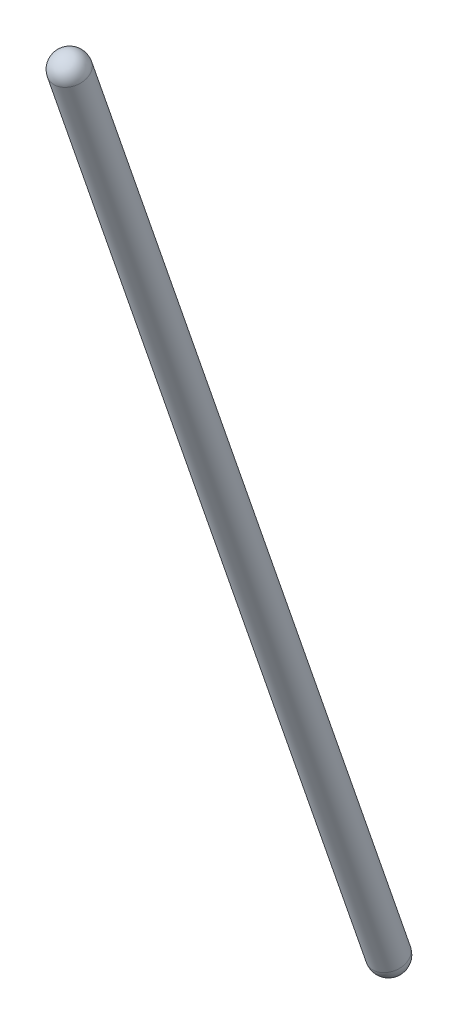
ISO-10303-21;
HEADER;
FILE_DESCRIPTION(('STEP AP214'),'2;1');
FILE_NAME('part.step','',(''),(''),'','','');
FILE_SCHEMA(('AUTOMOTIVE_DESIGN { 1 0 10303 214 1 1 1 1 }'));
ENDSEC;
DATA;
#1=APPLICATION_CONTEXT('core data for automotive mechanical design processes');
#2=APPLICATION_PROTOCOL_DEFINITION('international standard','automotive_design',2000,#1);
#3=PRODUCT_CONTEXT('',#1,'mechanical');
#4=PRODUCT('Part','Part','',(#3));
#5=PRODUCT_RELATED_PRODUCT_CATEGORY('part','',(#4));
#6=PRODUCT_DEFINITION_FORMATION('','',#4);
#7=PRODUCT_DEFINITION_CONTEXT('part definition',#1,'design');
#8=PRODUCT_DEFINITION('design','',#6,#7);
#9=PRODUCT_DEFINITION_SHAPE('','',#8);
#10=(LENGTH_UNIT() NAMED_UNIT(*) SI_UNIT(.MILLI.,.METRE.));
#11=(NAMED_UNIT(*) PLANE_ANGLE_UNIT() SI_UNIT($,.RADIAN.));
#12=(NAMED_UNIT(*) SI_UNIT($,.STERADIAN.) SOLID_ANGLE_UNIT());
#13=UNCERTAINTY_MEASURE_WITH_UNIT(LENGTH_MEASURE(1.E-05),#10,'distance_accuracy_value','');
#14=(GEOMETRIC_REPRESENTATION_CONTEXT(3) GLOBAL_UNCERTAINTY_ASSIGNED_CONTEXT((#13)) GLOBAL_UNIT_ASSIGNED_CONTEXT((#10,
#11,#12)) REPRESENTATION_CONTEXT('',''));
#15=CARTESIAN_POINT('',(0.,0.,0.));
#16=DIRECTION('',(0.,0.,1.));
#17=DIRECTION('',(1.,0.,0.));
#18=AXIS2_PLACEMENT_3D('',#15,#16,#17);
#19=CARTESIAN_POINT('',(-783.822223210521,-380.242671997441,-553.993910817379));
#20=DIRECTION('',(0.445220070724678,0.721584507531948,0.530183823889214));
#21=DIRECTION('',(-0.847586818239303,0.14868096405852,0.509402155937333));
#22=AXIS2_PLACEMENT_3D('',#19,#20,#21);
#23=SPHERICAL_SURFACE('',#22,2.794);
#24=CARTESIAN_POINT('',(-785.066168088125,-382.258779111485,-555.475244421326));
#25=VERTEX_POINT('',#24);
#26=VERTEX_LOOP('',#25);
#27=FACE_BOUND('',#26,.T.);
#28=CARTESIAN_POINT('',(-783.822223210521,-380.24267199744,-553.993910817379));
#29=DIRECTION('',(0.,0.945518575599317,0.325568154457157));
#30=DIRECTION('',(0.,-0.325568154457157,0.945518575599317));
#31=AXIS2_PLACEMENT_3D('',#28,#29,#30);
#32=CIRCLE('',#31,2.79400000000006);
#33=CARTESIAN_POINT('',(-783.822223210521,-381.152309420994,-551.352131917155));
#34=VERTEX_POINT('',#33);
#35=EDGE_CURVE('E42',#34,#34,#32,.T.);
#36=ORIENTED_EDGE('',*,*,#35,.F.);
#37=EDGE_LOOP('',(#36));
#38=FACE_BOUND('',#37,.T.);
#39=ADVANCED_FACE('F38',(#27,#38),#23,.T.);
#40=CARTESIAN_POINT('',(-783.822223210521,-224.137555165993,-500.242608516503));
#41=DIRECTION('',(0.445220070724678,0.721584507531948,0.530183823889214));
#42=DIRECTION('',(-0.847586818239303,0.14868096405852,0.509402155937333));
#43=AXIS2_PLACEMENT_3D('',#40,#41,#42);
#44=SPHERICAL_SURFACE('',#43,2.794);
#45=CARTESIAN_POINT('',(-783.822223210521,-224.137555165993,-500.242608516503));
#46=DIRECTION('',(0.,0.945518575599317,0.325568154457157));
#47=DIRECTION('',(0.,-0.325568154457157,0.945518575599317));
#48=AXIS2_PLACEMENT_3D('',#45,#46,#47);
#49=CIRCLE('',#48,2.79400000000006);
#50=CARTESIAN_POINT('',(-783.822223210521,-225.047192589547,-497.600829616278));
#51=VERTEX_POINT('',#50);
#52=EDGE_CURVE('E11',#51,#51,#49,.F.);
#53=ORIENTED_EDGE('',*,*,#52,.F.);
#54=EDGE_LOOP('',(#53));
#55=FACE_BOUND('',#54,.T.);
#56=CARTESIAN_POINT('',(-782.578278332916,-222.121448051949,-498.761274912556));
#57=VERTEX_POINT('',#56);
#58=VERTEX_LOOP('',#57);
#59=FACE_BOUND('',#58,.T.);
#60=ADVANCED_FACE('F52',(#55,#59),#44,.T.);
#61=CARTESIAN_POINT('',(-783.822223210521,-380.24267199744,-553.993910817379));
#62=DIRECTION('',(0.,0.945518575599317,0.325568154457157));
#63=DIRECTION('',(0.,-0.325568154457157,0.945518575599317));
#64=AXIS2_PLACEMENT_3D('',#61,#62,#63);
#65=CYLINDRICAL_SURFACE('',#64,2.79400000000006);
#66=ORIENTED_EDGE('',*,*,#35,.T.);
#67=EDGE_LOOP('',(#66));
#68=FACE_BOUND('',#67,.T.);
#69=ORIENTED_EDGE('',*,*,#52,.T.);
#70=EDGE_LOOP('',(#69));
#71=FACE_BOUND('',#70,.T.);
#72=ADVANCED_FACE('F40',(#68,#71),#65,.T.);
#73=CLOSED_SHELL('',(#39,#60,#72));
#74=MANIFOLD_SOLID_BREP('B2',#73);
#75=ADVANCED_BREP_SHAPE_REPRESENTATION('',(#18,#74),#14);
#76=SHAPE_DEFINITION_REPRESENTATION(#9,#75);
ENDSEC;
END-ISO-10303-21;
